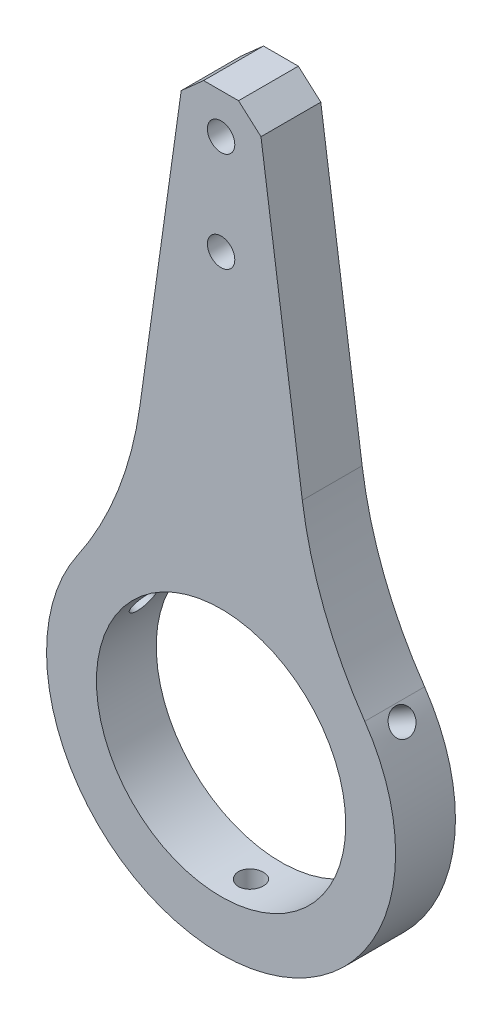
ISO-10303-21;
HEADER;
FILE_DESCRIPTION(('STEP AP214'),'2;1');
FILE_NAME('part.step','',(''),(''),'','','');
FILE_SCHEMA(('AUTOMOTIVE_DESIGN { 1 0 10303 214 1 1 1 1 }'));
ENDSEC;
DATA;
#1=APPLICATION_CONTEXT('core data for automotive mechanical design processes');
#2=APPLICATION_PROTOCOL_DEFINITION('international standard','automotive_design',2000,#1);
#3=PRODUCT_CONTEXT('',#1,'mechanical');
#4=PRODUCT('Part','Part','',(#3));
#5=PRODUCT_RELATED_PRODUCT_CATEGORY('part','',(#4));
#6=PRODUCT_DEFINITION_FORMATION('','',#4);
#7=PRODUCT_DEFINITION_CONTEXT('part definition',#1,'design');
#8=PRODUCT_DEFINITION('design','',#6,#7);
#9=PRODUCT_DEFINITION_SHAPE('','',#8);
#10=(LENGTH_UNIT() NAMED_UNIT(*) SI_UNIT(.MILLI.,.METRE.));
#11=(NAMED_UNIT(*) PLANE_ANGLE_UNIT() SI_UNIT($,.RADIAN.));
#12=(NAMED_UNIT(*) SI_UNIT($,.STERADIAN.) SOLID_ANGLE_UNIT());
#13=UNCERTAINTY_MEASURE_WITH_UNIT(LENGTH_MEASURE(1.E-05),#10,'distance_accuracy_value','');
#14=(GEOMETRIC_REPRESENTATION_CONTEXT(3) GLOBAL_UNCERTAINTY_ASSIGNED_CONTEXT((#13)) GLOBAL_UNIT_ASSIGNED_CONTEXT((#10,
#11,#12)) REPRESENTATION_CONTEXT('',''));
#15=CARTESIAN_POINT('',(0.,0.,0.));
#16=DIRECTION('',(0.,0.,1.));
#17=DIRECTION('',(1.,0.,0.));
#18=AXIS2_PLACEMENT_3D('',#15,#16,#17);
#19=CARTESIAN_POINT('',(-90.5619863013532,62.4381825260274,12.));
#20=DIRECTION('',(0.,0.,1.));
#21=DIRECTION('',(1.,0.,0.));
#22=AXIS2_PLACEMENT_3D('',#19,#20,#21);
#23=PLANE('',#22);
#24=CARTESIAN_POINT('',(0.,87.,12.));
#25=DIRECTION('',(0.,0.,1.));
#26=DIRECTION('',(1.,0.,0.));
#27=AXIS2_PLACEMENT_3D('',#24,#25,#26);
#28=CIRCLE('',#27,2.75);
#29=CARTESIAN_POINT('',(2.75000000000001,87.,12.));
#30=VERTEX_POINT('',#29);
#31=EDGE_CURVE('E273',#30,#30,#28,.T.);
#32=ORIENTED_EDGE('',*,*,#31,.F.);
#33=EDGE_LOOP('',(#32));
#34=FACE_BOUND('',#33,.T.);
#35=CARTESIAN_POINT('',(-90.5619863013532,62.4381825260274,12.));
#36=DIRECTION('',(0.,0.,-1.));
#37=DIRECTION('',(1.,0.,0.));
#38=AXIS2_PLACEMENT_3D('',#35,#36,#37);
#39=CIRCLE('',#38,75.);
#40=CARTESIAN_POINT('',(-16.2918811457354,52.000199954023,12.));
#41=VERTEX_POINT('',#40);
#42=CARTESIAN_POINT('',(-28.8151774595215,19.8666944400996,12.));
#43=VERTEX_POINT('',#42);
#44=EDGE_CURVE('E151',#41,#43,#39,.T.);
#45=ORIENTED_EDGE('',*,*,#44,.T.);
#46=CARTESIAN_POINT('',(0.,0.,12.));
#47=DIRECTION('',(0.,0.,1.));
#48=DIRECTION('',(1.,0.,0.));
#49=AXIS2_PLACEMENT_3D('',#46,#47,#48);
#50=CIRCLE('',#49,35.);
#51=CARTESIAN_POINT('',(28.8151774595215,19.8666944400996,12.));
#52=VERTEX_POINT('',#51);
#53=EDGE_CURVE('E99',#43,#52,#50,.T.);
#54=ORIENTED_EDGE('',*,*,#53,.T.);
#55=CARTESIAN_POINT('',(90.5619863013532,62.4381825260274,12.));
#56=DIRECTION('',(0.,0.,-1.));
#57=DIRECTION('',(-1.,0.,0.));
#58=AXIS2_PLACEMENT_3D('',#55,#56,#57);
#59=CIRCLE('',#58,75.);
#60=CARTESIAN_POINT('',(16.2918811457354,52.000199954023,12.));
#61=VERTEX_POINT('',#60);
#62=EDGE_CURVE('E263',#52,#61,#59,.T.);
#63=ORIENTED_EDGE('',*,*,#62,.T.);
#64=DIRECTION('',(-0.139173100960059,0.990268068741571,0.));
#65=VECTOR('',#64,1.);
#66=CARTESIAN_POINT('',(16.2918811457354,52.000199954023,12.));
#67=LINE('',#66,#65);
#68=CARTESIAN_POINT('',(8.,111.,12.));
#69=VERTEX_POINT('',#68);
#70=EDGE_CURVE('E270',#61,#69,#67,.T.);
#71=ORIENTED_EDGE('',*,*,#70,.T.);
#72=DIRECTION('',(-0.747409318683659,0.66436383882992,0.));
#73=VECTOR('',#72,1.);
#74=CARTESIAN_POINT('',(8.,111.,12.));
#75=LINE('',#74,#73);
#76=CARTESIAN_POINT('',(3.5,115.,12.));
#77=VERTEX_POINT('',#76);
#78=EDGE_CURVE('E118',#69,#77,#75,.T.);
#79=ORIENTED_EDGE('',*,*,#78,.T.);
#80=DIRECTION('',(-1.,0.,0.));
#81=VECTOR('',#80,1.);
#82=CARTESIAN_POINT('',(-3.5,115.,12.));
#83=LINE('',#82,#81);
#84=CARTESIAN_POINT('',(-3.5,115.,12.));
#85=VERTEX_POINT('',#84);
#86=EDGE_CURVE('E112',#77,#85,#83,.T.);
#87=ORIENTED_EDGE('',*,*,#86,.T.);
#88=DIRECTION('',(-0.747409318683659,-0.66436383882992,0.));
#89=VECTOR('',#88,1.);
#90=CARTESIAN_POINT('',(-8.,111.,12.));
#91=LINE('',#90,#89);
#92=CARTESIAN_POINT('',(-8.,111.,12.));
#93=VERTEX_POINT('',#92);
#94=EDGE_CURVE('E116',#85,#93,#91,.T.);
#95=ORIENTED_EDGE('',*,*,#94,.T.);
#96=DIRECTION('',(-0.139173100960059,-0.990268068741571,0.));
#97=VECTOR('',#96,1.);
#98=CARTESIAN_POINT('',(-16.2918811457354,52.000199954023,12.));
#99=LINE('',#98,#97);
#100=EDGE_CURVE('E56',#93,#41,#99,.T.);
#101=ORIENTED_EDGE('',*,*,#100,.T.);
#102=EDGE_LOOP('',(#45,#54,#63,#71,#79,#87,#95,#101));
#103=FACE_BOUND('',#102,.T.);
#104=CARTESIAN_POINT('',(0.,0.,12.));
#105=DIRECTION('',(0.,0.,1.));
#106=DIRECTION('',(1.,0.,0.));
#107=AXIS2_PLACEMENT_3D('',#104,#105,#106);
#108=CIRCLE('',#107,25.);
#109=CARTESIAN_POINT('',(25.,0.,12.));
#110=VERTEX_POINT('',#109);
#111=EDGE_CURVE('E140',#110,#110,#108,.T.);
#112=ORIENTED_EDGE('',*,*,#111,.F.);
#113=EDGE_LOOP('',(#112));
#114=FACE_BOUND('',#113,.T.);
#115=CARTESIAN_POINT('',(0.,107.,12.));
#116=DIRECTION('',(0.,0.,1.));
#117=DIRECTION('',(1.,0.,0.));
#118=AXIS2_PLACEMENT_3D('',#115,#116,#117);
#119=CIRCLE('',#118,2.75);
#120=CARTESIAN_POINT('',(2.75000000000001,107.,12.));
#121=VERTEX_POINT('',#120);
#122=EDGE_CURVE('E197',#121,#121,#119,.T.);
#123=ORIENTED_EDGE('',*,*,#122,.F.);
#124=EDGE_LOOP('',(#123));
#125=FACE_BOUND('',#124,.T.);
#126=ADVANCED_FACE('F33',(#34,#103,#114,#125),#23,.T.);
#127=CARTESIAN_POINT('',(-90.5619863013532,62.4381825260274,0.));
#128=DIRECTION('',(0.,0.,1.));
#129=DIRECTION('',(1.,0.,0.));
#130=AXIS2_PLACEMENT_3D('',#127,#128,#129);
#131=PLANE('',#130);
#132=CARTESIAN_POINT('',(0.,87.,0.));
#133=DIRECTION('',(0.,0.,1.));
#134=DIRECTION('',(1.,0.,0.));
#135=AXIS2_PLACEMENT_3D('',#132,#133,#134);
#136=CIRCLE('',#135,2.75);
#137=CARTESIAN_POINT('',(2.75000000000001,87.,0.));
#138=VERTEX_POINT('',#137);
#139=EDGE_CURVE('E276',#138,#138,#136,.T.);
#140=ORIENTED_EDGE('',*,*,#139,.T.);
#141=EDGE_LOOP('',(#140));
#142=FACE_BOUND('',#141,.T.);
#143=CARTESIAN_POINT('',(-90.5619863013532,62.4381825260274,0.));
#144=DIRECTION('',(0.,0.,-1.));
#145=DIRECTION('',(1.,0.,0.));
#146=AXIS2_PLACEMENT_3D('',#143,#144,#145);
#147=CIRCLE('',#146,75.);
#148=CARTESIAN_POINT('',(-16.2918811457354,52.000199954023,0.));
#149=VERTEX_POINT('',#148);
#150=CARTESIAN_POINT('',(-28.8151774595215,19.8666944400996,0.));
#151=VERTEX_POINT('',#150);
#152=EDGE_CURVE('E136',#149,#151,#147,.T.);
#153=ORIENTED_EDGE('',*,*,#152,.F.);
#154=DIRECTION('',(-0.139173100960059,-0.990268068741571,0.));
#155=VECTOR('',#154,1.);
#156=CARTESIAN_POINT('',(-16.2918811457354,52.000199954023,0.));
#157=LINE('',#156,#155);
#158=CARTESIAN_POINT('',(-8.,111.,0.));
#159=VERTEX_POINT('',#158);
#160=EDGE_CURVE('E91',#159,#149,#157,.T.);
#161=ORIENTED_EDGE('',*,*,#160,.F.);
#162=DIRECTION('',(-0.747409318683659,-0.66436383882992,0.));
#163=VECTOR('',#162,1.);
#164=CARTESIAN_POINT('',(-8.,111.,0.));
#165=LINE('',#164,#163);
#166=CARTESIAN_POINT('',(-3.5,115.,0.));
#167=VERTEX_POINT('',#166);
#168=EDGE_CURVE('E85',#167,#159,#165,.T.);
#169=ORIENTED_EDGE('',*,*,#168,.F.);
#170=DIRECTION('',(-1.,0.,0.));
#171=VECTOR('',#170,1.);
#172=CARTESIAN_POINT('',(-3.5,115.,0.));
#173=LINE('',#172,#171);
#174=CARTESIAN_POINT('',(3.5,115.,0.));
#175=VERTEX_POINT('',#174);
#176=EDGE_CURVE('E126',#175,#167,#173,.T.);
#177=ORIENTED_EDGE('',*,*,#176,.F.);
#178=DIRECTION('',(-0.747409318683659,0.66436383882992,0.));
#179=VECTOR('',#178,1.);
#180=CARTESIAN_POINT('',(8.,111.,0.));
#181=LINE('',#180,#179);
#182=CARTESIAN_POINT('',(8.,111.,0.));
#183=VERTEX_POINT('',#182);
#184=EDGE_CURVE('E146',#183,#175,#181,.T.);
#185=ORIENTED_EDGE('',*,*,#184,.F.);
#186=DIRECTION('',(-0.139173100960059,0.990268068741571,0.));
#187=VECTOR('',#186,1.);
#188=CARTESIAN_POINT('',(16.2918811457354,52.000199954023,0.));
#189=LINE('',#188,#187);
#190=CARTESIAN_POINT('',(16.2918811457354,52.000199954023,0.));
#191=VERTEX_POINT('',#190);
#192=EDGE_CURVE('E144',#191,#183,#189,.T.);
#193=ORIENTED_EDGE('',*,*,#192,.F.);
#194=CARTESIAN_POINT('',(90.5619863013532,62.4381825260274,0.));
#195=DIRECTION('',(0.,0.,-1.));
#196=DIRECTION('',(-1.,0.,0.));
#197=AXIS2_PLACEMENT_3D('',#194,#195,#196);
#198=CIRCLE('',#197,75.);
#199=CARTESIAN_POINT('',(28.8151774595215,19.8666944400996,0.));
#200=VERTEX_POINT('',#199);
#201=EDGE_CURVE('E142',#200,#191,#198,.T.);
#202=ORIENTED_EDGE('',*,*,#201,.F.);
#203=CARTESIAN_POINT('',(0.,0.,0.));
#204=DIRECTION('',(0.,0.,1.));
#205=DIRECTION('',(1.,0.,0.));
#206=AXIS2_PLACEMENT_3D('',#203,#204,#205);
#207=CIRCLE('',#206,35.);
#208=EDGE_CURVE('E139',#151,#200,#207,.T.);
#209=ORIENTED_EDGE('',*,*,#208,.F.);
#210=EDGE_LOOP('',(#153,#161,#169,#177,#185,#193,#202,#209));
#211=FACE_BOUND('',#210,.T.);
#212=CARTESIAN_POINT('',(0.,0.,0.));
#213=DIRECTION('',(0.,0.,1.));
#214=DIRECTION('',(1.,0.,0.));
#215=AXIS2_PLACEMENT_3D('',#212,#213,#214);
#216=CIRCLE('',#215,25.);
#217=CARTESIAN_POINT('',(25.,0.,0.));
#218=VERTEX_POINT('',#217);
#219=EDGE_CURVE('E266',#218,#218,#216,.T.);
#220=ORIENTED_EDGE('',*,*,#219,.T.);
#221=EDGE_LOOP('',(#220));
#222=FACE_BOUND('',#221,.T.);
#223=CARTESIAN_POINT('',(0.,107.,0.));
#224=DIRECTION('',(0.,0.,1.));
#225=DIRECTION('',(1.,0.,0.));
#226=AXIS2_PLACEMENT_3D('',#223,#224,#225);
#227=CIRCLE('',#226,2.75);
#228=CARTESIAN_POINT('',(2.75000000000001,107.,0.));
#229=VERTEX_POINT('',#228);
#230=EDGE_CURVE('E193',#229,#229,#227,.T.);
#231=ORIENTED_EDGE('',*,*,#230,.T.);
#232=EDGE_LOOP('',(#231));
#233=FACE_BOUND('',#232,.T.);
#234=ADVANCED_FACE('F224',(#142,#211,#222,#233),#131,.F.);
#235=CARTESIAN_POINT('',(-90.5619863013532,62.4381825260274,12.));
#236=DIRECTION('',(0.,0.,-1.));
#237=DIRECTION('',(-1.,0.,0.));
#238=AXIS2_PLACEMENT_3D('',#235,#236,#237);
#239=CYLINDRICAL_SURFACE('',#238,75.);
#240=ORIENTED_EDGE('',*,*,#152,.T.);
#241=DIRECTION('',(0.,0.,-1.));
#242=VECTOR('',#241,1.);
#243=CARTESIAN_POINT('',(-28.8151774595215,19.8666944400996,12.));
#244=LINE('',#243,#242);
#245=EDGE_CURVE('E11',#43,#151,#244,.T.);
#246=ORIENTED_EDGE('',*,*,#245,.F.);
#247=ORIENTED_EDGE('',*,*,#44,.F.);
#248=DIRECTION('',(0.,0.,-1.));
#249=VECTOR('',#248,1.);
#250=CARTESIAN_POINT('',(-16.2918811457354,52.000199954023,12.));
#251=LINE('',#250,#249);
#252=EDGE_CURVE('E132',#41,#149,#251,.T.);
#253=ORIENTED_EDGE('',*,*,#252,.T.);
#254=EDGE_LOOP('',(#240,#246,#247,#253));
#255=FACE_BOUND('',#254,.T.);
#256=ADVANCED_FACE('F35',(#255),#239,.F.);
#257=CARTESIAN_POINT('',(0.,0.,12.));
#258=DIRECTION('',(0.,0.,-1.));
#259=DIRECTION('',(-1.,0.,0.));
#260=AXIS2_PLACEMENT_3D('',#257,#258,#259);
#261=CYLINDRICAL_SURFACE('',#260,35.);
#262=CARTESIAN_POINT('',(-31.4834665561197,15.2902365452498,6.));
#263=CARTESIAN_POINT('',(-31.483464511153,15.2902424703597,5.85976621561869));
#264=CARTESIAN_POINT('',(-31.4782867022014,15.3009164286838,5.71943531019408));
#265=CARTESIAN_POINT('',(-31.4576455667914,15.3433070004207,5.44265148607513));
#266=CARTESIAN_POINT('',(-31.4421703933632,15.3750478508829,5.30620322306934));
#267=CARTESIAN_POINT('',(-31.4012010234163,15.4585485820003,5.04123380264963));
#268=CARTESIAN_POINT('',(-31.3757122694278,15.5102975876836,4.91270838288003));
#269=CARTESIAN_POINT('',(-31.3151712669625,15.6321673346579,4.66717594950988));
#270=CARTESIAN_POINT('',(-31.2801211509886,15.702283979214,4.55016637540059));
#271=CARTESIAN_POINT('',(-31.2010359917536,15.8588472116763,4.33072981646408));
#272=CARTESIAN_POINT('',(-31.1569857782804,15.9453213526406,4.22832795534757));
#273=CARTESIAN_POINT('',(-31.0608071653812,16.1318705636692,4.04122903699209));
#274=CARTESIAN_POINT('',(-31.008678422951,16.2319462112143,3.95653273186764));
#275=CARTESIAN_POINT('',(-30.8973975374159,16.442780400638,3.80716894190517));
#276=CARTESIAN_POINT('',(-30.8382380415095,16.5535501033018,3.74252268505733));
#277=CARTESIAN_POINT('',(-30.7143127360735,16.7823688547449,3.63522990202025));
#278=CARTESIAN_POINT('',(-30.6495470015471,16.9004178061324,3.59258308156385));
#279=CARTESIAN_POINT('',(-30.5161524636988,17.14010523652,3.5305706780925));
#280=CARTESIAN_POINT('',(-30.4475305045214,17.2617371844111,3.51116513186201));
#281=CARTESIAN_POINT('',(-30.3081751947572,17.5052618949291,3.49606266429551));
#282=CARTESIAN_POINT('',(-30.2374418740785,17.6271546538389,3.50036540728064));
#283=CARTESIAN_POINT('',(-30.096031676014,17.867520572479,3.53252453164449));
#284=CARTESIAN_POINT('',(-30.025354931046,17.9859995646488,3.56033793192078));
#285=CARTESIAN_POINT('',(-29.8860736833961,18.2164965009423,3.63866209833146));
#286=CARTESIAN_POINT('',(-29.8174691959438,18.3285143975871,3.68917303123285));
#287=CARTESIAN_POINT('',(-29.6844547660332,18.5431691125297,3.81150681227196));
#288=CARTESIAN_POINT('',(-29.6200487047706,18.645797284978,3.88334904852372));
#289=CARTESIAN_POINT('',(-29.4976358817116,18.8388578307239,4.04629200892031));
#290=CARTESIAN_POINT('',(-29.4396292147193,18.929290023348,4.13739301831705));
#291=CARTESIAN_POINT('',(-29.3318903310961,19.0958134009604,4.3365100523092));
#292=CARTESIAN_POINT('',(-29.2821768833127,19.1718721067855,4.44456339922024));
#293=CARTESIAN_POINT('',(-29.1929570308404,19.3074562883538,4.67438738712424));
#294=CARTESIAN_POINT('',(-29.1534506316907,19.3669817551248,4.79615803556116));
#295=CARTESIAN_POINT('',(-29.0860934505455,19.4679961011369,5.04998483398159));
#296=CARTESIAN_POINT('',(-29.0582436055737,19.5094835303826,5.18204180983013));
#297=CARTESIAN_POINT('',(-29.0152525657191,19.5733649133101,5.45268107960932));
#298=CARTESIAN_POINT('',(-29.0001111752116,19.5957591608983,5.5912632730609));
#299=CARTESIAN_POINT('',(-28.9831340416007,19.620860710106,5.87069152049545));
#300=CARTESIAN_POINT('',(-28.9812689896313,19.6236113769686,6.01153189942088));
#301=CARTESIAN_POINT('',(-28.9908383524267,19.6094712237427,6.29176650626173));
#302=CARTESIAN_POINT('',(-29.0022726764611,19.5925805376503,6.43116074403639));
#303=CARTESIAN_POINT('',(-29.0379852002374,19.5396116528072,6.70439765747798));
#304=CARTESIAN_POINT('',(-29.062249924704,19.5035535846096,6.83824599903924));
#305=CARTESIAN_POINT('',(-29.1227031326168,19.4131682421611,7.09676678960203));
#306=CARTESIAN_POINT('',(-29.1588917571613,19.3588407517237,7.2214391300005));
#307=CARTESIAN_POINT('',(-29.2419348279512,19.233172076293,7.45830839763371));
#308=CARTESIAN_POINT('',(-29.2888078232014,19.161801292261,7.57048311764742));
#309=CARTESIAN_POINT('',(-29.391501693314,19.0039068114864,7.7789489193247));
#310=CARTESIAN_POINT('',(-29.4473226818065,18.9173829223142,7.87523979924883));
#311=CARTESIAN_POINT('',(-29.566079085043,18.7312347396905,8.04938166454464));
#312=CARTESIAN_POINT('',(-29.6290272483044,18.6315869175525,8.12719881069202));
#313=CARTESIAN_POINT('',(-29.7598326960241,18.4219326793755,8.26195246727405));
#314=CARTESIAN_POINT('',(-29.8276899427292,18.3119263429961,8.31888913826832));
#315=CARTESIAN_POINT('',(-29.9660481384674,18.0846241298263,8.41020705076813));
#316=CARTESIAN_POINT('',(-30.0365465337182,17.9673352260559,8.44460951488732));
#317=CARTESIAN_POINT('',(-30.1780650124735,17.7286107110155,8.48995187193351));
#318=CARTESIAN_POINT('',(-30.2490850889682,17.6071751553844,8.5008920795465));
#319=CARTESIAN_POINT('',(-30.389406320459,17.363860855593,8.49899610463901));
#320=CARTESIAN_POINT('',(-30.4587109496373,17.2419836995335,8.48621279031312));
#321=CARTESIAN_POINT('',(-30.5938636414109,17.001017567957,8.43734251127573));
#322=CARTESIAN_POINT('',(-30.6597116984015,16.881928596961,8.40125550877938));
#323=CARTESIAN_POINT('',(-30.7862681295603,16.650019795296,8.30681481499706));
#324=CARTESIAN_POINT('',(-30.8469766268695,16.5371998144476,8.24846165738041));
#325=CARTESIAN_POINT('',(-30.9618224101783,16.3211683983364,8.11115174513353));
#326=CARTESIAN_POINT('',(-31.0159598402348,16.2179567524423,8.03219544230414));
#327=CARTESIAN_POINT('',(-31.1165941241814,16.0240304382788,7.85572324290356));
#328=CARTESIAN_POINT('',(-31.1630746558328,15.9333425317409,7.75816863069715));
#329=CARTESIAN_POINT('',(-31.2473275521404,15.7674728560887,7.54733062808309));
#330=CARTESIAN_POINT('',(-31.2850977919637,15.6922948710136,7.43404341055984));
#331=CARTESIAN_POINT('',(-31.3512505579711,15.5597109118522,7.19479142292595));
#332=CARTESIAN_POINT('',(-31.3796190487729,15.5023315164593,7.06880806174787));
#333=CARTESIAN_POINT('',(-31.4263576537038,15.4073642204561,6.80796452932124));
#334=CARTESIAN_POINT('',(-31.4447393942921,15.3697533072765,6.67311488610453));
#335=CARTESIAN_POINT('',(-31.4664605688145,15.3252147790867,6.4478762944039));
#336=CARTESIAN_POINT('',(-31.4728323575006,15.3121167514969,6.35894055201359));
#337=CARTESIAN_POINT('',(-31.4813360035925,15.2946257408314,6.18001654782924));
#338=CARTESIAN_POINT('',(-31.4834678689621,15.2902327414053,6.09002828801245));
#339=CARTESIAN_POINT('',(-31.4834665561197,15.2902365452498,6.));
#340=B_SPLINE_CURVE_WITH_KNOTS('',3,(#262,#263,#264,#265,#266,#267,#268,#269,#270,#271,#272,
#273,#274,#275,#276,#277,#278,#279,#280,#281,#282,#283,#284,#285,#286,#287,#288,#289,#290,#291,
#292,#293,#294,#295,#296,#297,#298,#299,#300,#301,#302,#303,#304,#305,#306,#307,#308,#309,#310,
#311,#312,#313,#314,#315,#316,#317,#318,#319,#320,#321,#322,#323,#324,#325,#326,#327,#328,#329,
#330,#331,#332,#333,#334,#335,#336,#337,#338,#339),.UNSPECIFIED.,.T.,.F.,(4,2,2,2,2,2,2,2,2,2,2,
2,2,2,2,2,2,2,2,2,2,2,2,2,2,2,2,2,2,2,2,2,2,2,2,2,2,2,4),(0.,0.420372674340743,0.84122981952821,
1.26185853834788,1.68239351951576,2.10364327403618,2.52491091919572,2.94662307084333,
3.3683295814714,3.78930992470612,4.21028430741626,4.63049074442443,5.05070026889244,
5.47129289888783,5.89189175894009,6.31342995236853,6.73496837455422,7.15654067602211,
7.57810648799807,7.99874136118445,8.41937336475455,8.83956446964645,9.25976054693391,
9.68069175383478,10.101628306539,10.5233300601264,10.9450285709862,11.3663293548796,
11.7876244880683,12.2079818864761,12.6283399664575,13.0486879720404,13.4690267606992,
13.8902503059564,14.311576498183,14.7335288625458,15.1549889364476,15.4248632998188,
15.694737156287),.UNSPECIFIED.);
#341=CARTESIAN_POINT('',(-31.4834665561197,15.2902365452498,6.));
#342=VERTEX_POINT('',#341);
#343=EDGE_CURVE('E208',#342,#342,#340,.T.);
#344=ORIENTED_EDGE('',*,*,#343,.T.);
#345=EDGE_LOOP('',(#344));
#346=FACE_BOUND('',#345,.T.);
#347=CARTESIAN_POINT('',(28.9834665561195,19.6203635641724,6.));
#348=CARTESIAN_POINT('',(28.9834706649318,19.6203588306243,5.85976621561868));
#349=CARTESIAN_POINT('',(28.9901256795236,19.6105377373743,5.71943531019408));
#350=CARTESIAN_POINT('',(29.0165164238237,19.5714667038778,5.44265148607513));
#351=CARTESIAN_POINT('',(29.0362672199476,19.5421943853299,5.30620322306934));
#352=CARTESIAN_POINT('',(29.0880962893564,19.4649635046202,5.04123380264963));
#353=CARTESIAN_POINT('',(29.1201678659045,19.4170150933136,4.91270838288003));
#354=CARTESIAN_POINT('',(29.1954396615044,19.303650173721,4.66717594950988));
#355=CARTESIAN_POINT('',(29.2386373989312,19.2382375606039,4.55016637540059));
#356=CARTESIAN_POINT('',(29.3346825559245,19.0914661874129,4.33072981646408));
#357=CARTESIAN_POINT('',(29.3875462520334,19.0100805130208,4.22832795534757));
#358=CARTESIAN_POINT('',(29.5010133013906,18.8335127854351,4.04122903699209));
#359=CARTESIAN_POINT('',(29.5616169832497,18.7383301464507,3.95653273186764));
#360=CARTESIAN_POINT('',(29.6885643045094,18.5365409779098,3.80716894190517));
#361=CARTESIAN_POINT('',(29.7549139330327,18.4299225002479,3.74252268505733));
#362=CARTESIAN_POINT('',(29.8911141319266,18.208190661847,3.63522990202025));
#363=CARTESIAN_POINT('',(29.9609646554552,18.0930774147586,3.59258308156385));
#364=CARTESIAN_POINT('',(30.1018427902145,17.8577106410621,3.5305706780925));
#365=CARTESIAN_POINT('',(30.1728681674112,17.7374663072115,3.51116513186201));
#366=CARTESIAN_POINT('',(30.314089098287,17.4950187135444,3.49606266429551));
#367=CARTESIAN_POINT('',(30.3842846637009,17.3728154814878,3.50036540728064));
#368=CARTESIAN_POINT('',(30.521742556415,17.1301676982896,3.53252453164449));
#369=CARTESIAN_POINT('',(30.5890100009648,17.0097203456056,3.56033793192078));
#370=CARTESIAN_POINT('',(30.7189855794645,16.7738507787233,3.63866209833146));
#371=CARTESIAN_POINT('',(30.7816936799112,16.6584286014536,3.68917303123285));
#372=CARTESIAN_POINT('',(30.9010829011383,16.4359073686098,3.81150681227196));
#373=CARTESIAN_POINT('',(30.9577584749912,16.3288159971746,3.88334904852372));
#374=CARTESIAN_POINT('',(31.0637474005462,16.1262731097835,4.04629200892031));
#375=CARTESIAN_POINT('',(31.1130606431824,16.0308217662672,4.13739301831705));
#376=CARTESIAN_POINT('',(31.2034046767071,15.8542554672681,4.3365100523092));
#377=CARTESIAN_POINT('',(31.2444167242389,15.7731730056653,4.44456339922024));
#378=CARTESIAN_POINT('',(31.3172261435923,15.6281142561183,4.67438738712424));
#379=CARTESIAN_POINT('',(31.3490235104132,15.5641379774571,4.79615803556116));
#380=CARTESIAN_POINT('',(31.4028259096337,15.455297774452,5.04998483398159));
#381=CARTESIAN_POINT('',(31.4248301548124,15.4104353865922,5.18204180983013));
#382=CARTESIAN_POINT('',(31.4586575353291,15.3412633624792,5.45268107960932));
#383=CARTESIAN_POINT('',(31.4704808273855,15.3169534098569,5.5912632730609));
#384=CARTESIAN_POINT('',(31.4837308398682,15.2897000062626,5.87069152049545));
#385=CARTESIAN_POINT('',(31.4851804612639,15.2867094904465,6.01153189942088));
#386=CARTESIAN_POINT('',(31.4777194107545,15.3020668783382,6.29176650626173));
#387=CARTESIAN_POINT('',(31.4688088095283,15.3204146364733,6.43116074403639));
#388=CARTESIAN_POINT('',(31.4407926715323,15.3778270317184,6.70439765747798));
#389=CARTESIAN_POINT('',(31.4216978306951,15.416869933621,6.83824599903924));
#390=CARTESIAN_POINT('',(31.3736484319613,15.5144166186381,7.09676678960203));
#391=CARTESIAN_POINT('',(31.3446937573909,15.5729206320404,7.2214391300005));
#392=CARTESIAN_POINT('',(31.2773830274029,15.7076723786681,7.45830839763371));
#393=CARTESIAN_POINT('',(31.2390106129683,15.7839509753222,7.57048311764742));
#394=CARTESIAN_POINT('',(31.1536169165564,15.95183371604,7.7789489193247));
#395=CARTESIAN_POINT('',(31.1065955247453,16.0434380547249,7.87523979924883));
#396=CARTESIAN_POINT('',(31.0047646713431,16.2393582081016,8.04938166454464));
#397=CARTESIAN_POINT('',(30.9499412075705,16.3436968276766,8.12719881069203));
#398=CARTESIAN_POINT('',(30.833778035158,16.5618047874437,8.26195246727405));
#399=CARTESIAN_POINT('',(30.7724383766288,16.6755740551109,8.31888913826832));
#400=CARTESIAN_POINT('',(30.6447679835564,16.9090468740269,8.41020705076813));
#401=CARTESIAN_POINT('',(30.5784420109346,17.0287447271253,8.44460951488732));
#402=CARTESIAN_POINT('',(30.4424597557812,17.2706655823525,8.48995187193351));
#403=CARTESIAN_POINT('',(30.3728035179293,17.3928885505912,8.5008920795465));
#404=CARTESIAN_POINT('',(30.2322477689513,17.6360674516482,8.49899610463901));
#405=CARTESIAN_POINT('',(30.161351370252,17.7570255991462,8.48621279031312));
#406=CARTESIAN_POINT('',(30.0202449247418,17.9945543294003,8.43734251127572));
#407=CARTESIAN_POINT('',(29.9500348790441,18.111124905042,8.40125550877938));
#408=CARTESIAN_POINT('',(29.8124741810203,18.3366803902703,8.30681481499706));
#409=CARTESIAN_POINT('',(29.7451234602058,18.4456654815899,8.24846165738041));
#410=CARTESIAN_POINT('',(29.6154576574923,18.6531405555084,8.11115174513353));
#411=CARTESIAN_POINT('',(29.5531424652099,18.75163076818,8.03219544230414));
#412=CARTESIAN_POINT('',(29.4355144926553,18.9357457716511,7.85572324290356));
#413=CARTESIAN_POINT('',(29.3802167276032,19.0213430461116,7.75816863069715));
#414=CARTESIAN_POINT('',(29.2786958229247,19.1772430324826,7.5473306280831));
#415=CARTESIAN_POINT('',(29.232474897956,19.2475420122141,7.43404341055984));
#416=CARTESIAN_POINT('',(29.1507302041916,19.3711239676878,7.19479142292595));
#417=CARTESIAN_POINT('',(29.1152224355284,19.4243814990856,7.06880806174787));
#418=CARTESIAN_POINT('',(29.0563476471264,19.5123419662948,6.80796452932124));
#419=CARTESIAN_POINT('',(29.0329665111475,19.5470664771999,6.67311488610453));
#420=CARTESIAN_POINT('',(29.0052556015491,19.5881468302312,6.44787629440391));
#421=CARTESIAN_POINT('',(28.9970982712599,19.6002139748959,6.35894055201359));
#422=CARTESIAN_POINT('',(28.9862024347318,19.616323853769,6.18001654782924));
#423=CARTESIAN_POINT('',(28.9834639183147,19.6203666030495,6.09002828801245));
#424=CARTESIAN_POINT('',(28.9834665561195,19.6203635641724,6.));
#425=B_SPLINE_CURVE_WITH_KNOTS('',3,(#347,#348,#349,#350,#351,#352,#353,#354,#355,#356,#357,
#358,#359,#360,#361,#362,#363,#364,#365,#366,#367,#368,#369,#370,#371,#372,#373,#374,#375,#376,
#377,#378,#379,#380,#381,#382,#383,#384,#385,#386,#387,#388,#389,#390,#391,#392,#393,#394,#395,
#396,#397,#398,#399,#400,#401,#402,#403,#404,#405,#406,#407,#408,#409,#410,#411,#412,#413,#414,
#415,#416,#417,#418,#419,#420,#421,#422,#423,#424),.UNSPECIFIED.,.T.,.F.,(4,2,2,2,2,2,2,2,2,2,2,
2,2,2,2,2,2,2,2,2,2,2,2,2,2,2,2,2,2,2,2,2,2,2,2,2,2,2,4),(0.,0.420372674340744,0.84122981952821,
1.26185853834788,1.68239351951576,2.10364327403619,2.52491091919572,2.94662307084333,
3.36832958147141,3.78930992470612,4.21028430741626,4.63049074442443,5.05070026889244,
5.47129289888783,5.89189175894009,6.31342995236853,6.73496837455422,7.15654067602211,
7.57810648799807,7.99874136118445,8.41937336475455,8.83956446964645,9.25976054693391,
9.68069175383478,10.101628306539,10.5233300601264,10.9450285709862,11.3663293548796,
11.7876244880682,12.2079818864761,12.6283399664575,13.0486879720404,13.4690267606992,
13.8902503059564,14.311576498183,14.7335288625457,15.1549889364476,15.4248632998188,
15.694737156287),.UNSPECIFIED.);
#426=CARTESIAN_POINT('',(28.9834665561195,19.6203635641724,6.));
#427=VERTEX_POINT('',#426);
#428=EDGE_CURVE('E169',#427,#427,#425,.T.);
#429=ORIENTED_EDGE('',*,*,#428,.T.);
#430=EDGE_LOOP('',(#429));
#431=FACE_BOUND('',#430,.T.);
#432=CARTESIAN_POINT('',(2.5,-34.9106001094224,6.));
#433=CARTESIAN_POINT('',(2.49999384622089,-34.9106013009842,5.85976621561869));
#434=CARTESIAN_POINT('',(2.48816102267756,-34.9114541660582,5.71943531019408));
#435=CARTESIAN_POINT('',(2.44112914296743,-34.9147737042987,5.44265148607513));
#436=CARTESIAN_POINT('',(2.40590317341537,-34.9172422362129,5.30620322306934));
#437=CARTESIAN_POINT('',(2.31310473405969,-34.9235120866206,5.04123380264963));
#438=CARTESIAN_POINT('',(2.2555444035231,-34.9273126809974,4.91270838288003));
#439=CARTESIAN_POINT('',(2.11973160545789,-34.935817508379,4.66717594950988));
#440=CARTESIAN_POINT('',(2.04148375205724,-34.9405215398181,4.55016637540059));
#441=CARTESIAN_POINT('',(1.8663534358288,-34.9503133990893,4.33072981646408));
#442=CARTESIAN_POINT('',(1.76943952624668,-34.9554018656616,4.22832795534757));
#443=CARTESIAN_POINT('',(1.55979386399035,-34.9653833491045,4.04122903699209));
#444=CARTESIAN_POINT('',(1.44706143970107,-34.9702763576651,3.95653273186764));
#445=CARTESIAN_POINT('',(1.20883323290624,-34.979321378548,3.80716894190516));
#446=CARTESIAN_POINT('',(1.08332410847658,-34.9834726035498,3.74252268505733));
#447=CARTESIAN_POINT('',(0.82319860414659,-34.990559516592,3.63522990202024));
#448=CARTESIAN_POINT('',(0.688582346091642,-34.9934952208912,3.59258308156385));
#449=CARTESIAN_POINT('',(0.414309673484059,-34.9978158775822,3.5305706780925));
#450=CARTESIAN_POINT('',(0.27466233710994,-34.9992034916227,3.51116513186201));
#451=CARTESIAN_POINT('',(-0.00591390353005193,-35.0002806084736,3.49606266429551));
#452=CARTESIAN_POINT('',(-0.146842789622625,-34.9999701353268,3.50036540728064));
#453=CARTESIAN_POINT('',(-0.4257108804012,-34.9976882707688,3.53252453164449));
#454=CARTESIAN_POINT('',(-0.563655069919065,-34.9957199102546,3.56033793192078));
#455=CARTESIAN_POINT('',(-0.832911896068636,-34.9903472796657,3.63866209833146));
#456=CARTESIAN_POINT('',(-0.96422448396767,-34.9869429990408,3.68917303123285));
#457=CARTESIAN_POINT('',(-1.21662813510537,-34.9790764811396,3.81150681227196));
#458=CARTESIAN_POINT('',(-1.33770977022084,-34.9746132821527,3.88334904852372));
#459=CARTESIAN_POINT('',(-1.56611151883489,-34.9651309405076,4.04629200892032));
#460=CARTESIAN_POINT('',(-1.67343142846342,-34.9601117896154,4.13739301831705));
#461=CARTESIAN_POINT('',(-1.87151434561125,-34.9500688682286,4.3365100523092));
#462=CARTESIAN_POINT('',(-1.96223984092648,-34.9450451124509,4.44456339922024));
#463=CARTESIAN_POINT('',(-2.1242691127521,-34.9355705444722,4.67438738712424));
#464=CARTESIAN_POINT('',(-2.19557287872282,-34.931119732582,4.79615803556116));
#465=CARTESIAN_POINT('',(-2.31673245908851,-34.9232938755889,5.04998483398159));
#466=CARTESIAN_POINT('',(-2.36658654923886,-34.9199189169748,5.18204180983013));
#467=CARTESIAN_POINT('',(-2.44340496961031,-34.9146282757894,5.45268107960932));
#468=CARTESIAN_POINT('',(-2.47036965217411,-34.9127125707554,5.5912632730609));
#469=CARTESIAN_POINT('',(-2.50059679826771,-34.9105607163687,5.87069152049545));
#470=CARTESIAN_POINT('',(-2.50391147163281,-34.9103208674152,6.01153189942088));
#471=CARTESIAN_POINT('',(-2.48688105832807,-34.911538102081,6.29176650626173));
#472=CARTESIAN_POINT('',(-2.46653613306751,-34.9129951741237,6.43116074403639));
#473=CARTESIAN_POINT('',(-2.40280747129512,-34.9174386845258,6.70439765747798));
#474=CARTESIAN_POINT('',(-2.35944790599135,-34.9204235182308,6.83824599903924));
#475=CARTESIAN_POINT('',(-2.25094529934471,-34.9275848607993,7.09676678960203));
#476=CARTESIAN_POINT('',(-2.18580200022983,-34.9317613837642,7.2214391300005));
#477=CARTESIAN_POINT('',(-2.03544819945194,-34.9408444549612,7.45830839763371));
#478=CARTESIAN_POINT('',(-1.95020278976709,-34.9457522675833,7.57048311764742));
#479=CARTESIAN_POINT('',(-1.76211522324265,-34.9557405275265,7.7789489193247));
#480=CARTESIAN_POINT('',(-1.65927284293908,-34.9608209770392,7.87523979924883));
#481=CARTESIAN_POINT('',(-1.43868558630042,-34.9705929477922,8.04938166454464));
#482=CARTESIAN_POINT('',(-1.32091395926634,-34.9752837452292,8.12719881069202));
#483=CARTESIAN_POINT('',(-1.07394533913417,-34.9837374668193,8.26195246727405));
#484=CARTESIAN_POINT('',(-0.944748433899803,-34.9875003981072,8.31888913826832));
#485=CARTESIAN_POINT('',(-0.678719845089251,-34.9936710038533,8.41020705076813));
#486=CARTESIAN_POINT('',(-0.541895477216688,-34.9960799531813,8.44460951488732));
#487=CARTESIAN_POINT('',(-0.264394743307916,-34.9992762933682,8.48995187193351));
#488=CARTESIAN_POINT('',(-0.123718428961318,-35.0000637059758,8.5008920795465));
#489=CARTESIAN_POINT('',(0.157158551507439,-34.9999283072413,8.49899610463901));
#490=CARTESIAN_POINT('',(0.297359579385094,-34.9990092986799,8.48621279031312));
#491=CARTESIAN_POINT('',(0.573618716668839,-34.9955718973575,8.43734251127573));
#492=CARTESIAN_POINT('',(0.709676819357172,-34.9930535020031,8.40125550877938));
#493=CARTESIAN_POINT('',(0.973793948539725,-34.9867001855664,8.30681481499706));
#494=CARTESIAN_POINT('',(1.1018531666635,-34.9828652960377,8.24846165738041));
#495=CARTESIAN_POINT('',(1.34636475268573,-34.9743089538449,8.11115174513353));
#496=CARTESIAN_POINT('',(1.46281737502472,-34.9695875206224,8.03219544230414));
#497=CARTESIAN_POINT('',(1.68107963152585,-34.9597762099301,7.85572324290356));
#498=CARTESIAN_POINT('',(1.78285792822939,-34.9546855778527,7.75816863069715));
#499=CARTESIAN_POINT('',(1.96863172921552,-34.9447158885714,7.54733062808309));
#500=CARTESIAN_POINT('',(2.05262289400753,-34.9398368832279,7.43404341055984));
#501=CARTESIAN_POINT('',(2.20052035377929,-34.9308348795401,7.19479142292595));
#502=CARTESIAN_POINT('',(2.26439661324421,-34.9267130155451,7.06880806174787));
#503=CARTESIAN_POINT('',(2.37001000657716,-34.9197061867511,6.80796452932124));
#504=CARTESIAN_POINT('',(2.41177288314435,-34.9168197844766,6.67311488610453));
#505=CARTESIAN_POINT('',(2.46120496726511,-34.9133616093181,6.4478762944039));
#506=CARTESIAN_POINT('',(2.47573408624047,-34.9123307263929,6.35894055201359));
#507=CARTESIAN_POINT('',(2.49513356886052,-34.9109495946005,6.18001654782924));
#508=CARTESIAN_POINT('',(2.50000395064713,-34.910599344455,6.09002828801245));
#509=CARTESIAN_POINT('',(2.5,-34.9106001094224,6.));
#510=B_SPLINE_CURVE_WITH_KNOTS('',3,(#432,#433,#434,#435,#436,#437,#438,#439,#440,#441,#442,
#443,#444,#445,#446,#447,#448,#449,#450,#451,#452,#453,#454,#455,#456,#457,#458,#459,#460,#461,
#462,#463,#464,#465,#466,#467,#468,#469,#470,#471,#472,#473,#474,#475,#476,#477,#478,#479,#480,
#481,#482,#483,#484,#485,#486,#487,#488,#489,#490,#491,#492,#493,#494,#495,#496,#497,#498,#499,
#500,#501,#502,#503,#504,#505,#506,#507,#508,#509),.UNSPECIFIED.,.T.,.F.,(4,2,2,2,2,2,2,2,2,2,2,
2,2,2,2,2,2,2,2,2,2,2,2,2,2,2,2,2,2,2,2,2,2,2,2,2,2,2,4),(0.,0.420372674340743,0.84122981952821,
1.26185853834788,1.68239351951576,2.10364327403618,2.52491091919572,2.94662307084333,
3.36832958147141,3.78930992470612,4.21028430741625,4.63049074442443,5.05070026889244,
5.47129289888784,5.89189175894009,6.31342995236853,6.73496837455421,7.15654067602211,
7.57810648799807,7.99874136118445,8.41937336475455,8.83956446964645,9.25976054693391,
9.68069175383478,10.101628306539,10.5233300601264,10.9450285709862,11.3663293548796,
11.7876244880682,12.2079818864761,12.6283399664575,13.0486879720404,13.4690267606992,
13.8902503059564,14.311576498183,14.7335288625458,15.1549889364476,15.4248632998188,
15.694737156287),.UNSPECIFIED.);
#511=CARTESIAN_POINT('',(2.5,-34.9106001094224,6.));
#512=VERTEX_POINT('',#511);
#513=EDGE_CURVE('E168',#512,#512,#510,.T.);
#514=ORIENTED_EDGE('',*,*,#513,.T.);
#515=EDGE_LOOP('',(#514));
#516=FACE_BOUND('',#515,.T.);
#517=ORIENTED_EDGE('',*,*,#208,.T.);
#518=DIRECTION('',(0.,0.,-1.));
#519=VECTOR('',#518,1.);
#520=CARTESIAN_POINT('',(28.8151774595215,19.8666944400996,12.));
#521=LINE('',#520,#519);
#522=EDGE_CURVE('E47',#52,#200,#521,.T.);
#523=ORIENTED_EDGE('',*,*,#522,.F.);
#524=ORIENTED_EDGE('',*,*,#53,.F.);
#525=ORIENTED_EDGE('',*,*,#245,.T.);
#526=EDGE_LOOP('',(#517,#523,#524,#525));
#527=FACE_BOUND('',#526,.T.);
#528=ADVANCED_FACE('F199',(#346,#431,#516,#527),#261,.T.);
#529=CARTESIAN_POINT('',(90.5619863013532,62.4381825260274,12.));
#530=DIRECTION('',(0.,0.,-1.));
#531=DIRECTION('',(-1.,0.,0.));
#532=AXIS2_PLACEMENT_3D('',#529,#530,#531);
#533=CYLINDRICAL_SURFACE('',#532,75.);
#534=ORIENTED_EDGE('',*,*,#201,.T.);
#535=DIRECTION('',(0.,0.,-1.));
#536=VECTOR('',#535,1.);
#537=CARTESIAN_POINT('',(16.2918811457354,52.000199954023,12.));
#538=LINE('',#537,#536);
#539=EDGE_CURVE('E158',#61,#191,#538,.T.);
#540=ORIENTED_EDGE('',*,*,#539,.F.);
#541=ORIENTED_EDGE('',*,*,#62,.F.);
#542=ORIENTED_EDGE('',*,*,#522,.T.);
#543=EDGE_LOOP('',(#534,#540,#541,#542));
#544=FACE_BOUND('',#543,.T.);
#545=ADVANCED_FACE('F203',(#544),#533,.F.);
#546=CARTESIAN_POINT('',(16.2918811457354,52.000199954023,12.));
#547=DIRECTION('',(-0.990268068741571,-0.139173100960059,0.));
#548=DIRECTION('',(0.139173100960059,-0.990268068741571,0.));
#549=AXIS2_PLACEMENT_3D('',#546,#547,#548);
#550=PLANE('',#549);
#551=ORIENTED_EDGE('',*,*,#192,.T.);
#552=DIRECTION('',(0.,0.,-1.));
#553=VECTOR('',#552,1.);
#554=CARTESIAN_POINT('',(8.,111.,12.));
#555=LINE('',#554,#553);
#556=EDGE_CURVE('E155',#69,#183,#555,.T.);
#557=ORIENTED_EDGE('',*,*,#556,.F.);
#558=ORIENTED_EDGE('',*,*,#70,.F.);
#559=ORIENTED_EDGE('',*,*,#539,.T.);
#560=EDGE_LOOP('',(#551,#557,#558,#559));
#561=FACE_BOUND('',#560,.T.);
#562=ADVANCED_FACE('F242',(#561),#550,.F.);
#563=CARTESIAN_POINT('',(8.,111.,12.));
#564=DIRECTION('',(-0.66436383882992,-0.747409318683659,0.));
#565=DIRECTION('',(0.747409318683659,-0.66436383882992,0.));
#566=AXIS2_PLACEMENT_3D('',#563,#564,#565);
#567=PLANE('',#566);
#568=ORIENTED_EDGE('',*,*,#184,.T.);
#569=DIRECTION('',(0.,0.,-1.));
#570=VECTOR('',#569,1.);
#571=CARTESIAN_POINT('',(3.5,115.,12.));
#572=LINE('',#571,#570);
#573=EDGE_CURVE('E127',#77,#175,#572,.T.);
#574=ORIENTED_EDGE('',*,*,#573,.F.);
#575=ORIENTED_EDGE('',*,*,#78,.F.);
#576=ORIENTED_EDGE('',*,*,#556,.T.);
#577=EDGE_LOOP('',(#568,#574,#575,#576));
#578=FACE_BOUND('',#577,.T.);
#579=ADVANCED_FACE('F240',(#578),#567,.F.);
#580=CARTESIAN_POINT('',(-3.5,115.,12.));
#581=DIRECTION('',(0.,-1.,0.));
#582=DIRECTION('',(0.,0.,-1.));
#583=AXIS2_PLACEMENT_3D('',#580,#581,#582);
#584=PLANE('',#583);
#585=ORIENTED_EDGE('',*,*,#176,.T.);
#586=DIRECTION('',(0.,0.,-1.));
#587=VECTOR('',#586,1.);
#588=CARTESIAN_POINT('',(-3.5,115.,12.));
#589=LINE('',#588,#587);
#590=EDGE_CURVE('E123',#85,#167,#589,.T.);
#591=ORIENTED_EDGE('',*,*,#590,.F.);
#592=ORIENTED_EDGE('',*,*,#86,.F.);
#593=ORIENTED_EDGE('',*,*,#573,.T.);
#594=EDGE_LOOP('',(#585,#591,#592,#593));
#595=FACE_BOUND('',#594,.T.);
#596=ADVANCED_FACE('F124',(#595),#584,.F.);
#597=CARTESIAN_POINT('',(-8.,111.,12.));
#598=DIRECTION('',(0.66436383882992,-0.747409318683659,0.));
#599=DIRECTION('',(0.747409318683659,0.66436383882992,0.));
#600=AXIS2_PLACEMENT_3D('',#597,#598,#599);
#601=PLANE('',#600);
#602=ORIENTED_EDGE('',*,*,#168,.T.);
#603=DIRECTION('',(0.,0.,-1.));
#604=VECTOR('',#603,1.);
#605=CARTESIAN_POINT('',(-8.,111.,12.));
#606=LINE('',#605,#604);
#607=EDGE_CURVE('E128',#93,#159,#606,.T.);
#608=ORIENTED_EDGE('',*,*,#607,.F.);
#609=ORIENTED_EDGE('',*,*,#94,.F.);
#610=ORIENTED_EDGE('',*,*,#590,.T.);
#611=EDGE_LOOP('',(#602,#608,#609,#610));
#612=FACE_BOUND('',#611,.T.);
#613=ADVANCED_FACE('F130',(#612),#601,.F.);
#614=CARTESIAN_POINT('',(-16.2918811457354,52.000199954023,12.));
#615=DIRECTION('',(0.990268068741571,-0.139173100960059,0.));
#616=DIRECTION('',(0.139173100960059,0.990268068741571,0.));
#617=AXIS2_PLACEMENT_3D('',#614,#615,#616);
#618=PLANE('',#617);
#619=ORIENTED_EDGE('',*,*,#160,.T.);
#620=ORIENTED_EDGE('',*,*,#252,.F.);
#621=ORIENTED_EDGE('',*,*,#100,.F.);
#622=ORIENTED_EDGE('',*,*,#607,.T.);
#623=EDGE_LOOP('',(#619,#620,#621,#622));
#624=FACE_BOUND('',#623,.T.);
#625=ADVANCED_FACE('F233',(#624),#618,.F.);
#626=CARTESIAN_POINT('',(0.,0.,12.));
#627=DIRECTION('',(0.,0.,-1.));
#628=DIRECTION('',(-1.,0.,0.));
#629=AXIS2_PLACEMENT_3D('',#626,#627,#628);
#630=CYLINDRICAL_SURFACE('',#629,25.);
#631=CARTESIAN_POINT('',(-22.7921099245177,10.2722794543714,6.));
#632=CARTESIAN_POINT('',(-22.7921083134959,10.2722855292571,5.85995108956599));
#633=CARTESIAN_POINT('',(-22.7872413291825,10.2831031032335,5.7198095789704));
#634=CARTESIAN_POINT('',(-22.7678139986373,10.3260437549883,5.44341203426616));
#635=CARTESIAN_POINT('',(-22.7532429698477,10.3581903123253,5.30716045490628));
#636=CARTESIAN_POINT('',(-22.7145818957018,10.4426967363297,5.04258545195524));
#637=CARTESIAN_POINT('',(-22.690497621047,10.4950443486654,4.9142572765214));
#638=CARTESIAN_POINT('',(-22.6331174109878,10.6182197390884,4.66908051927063));
#639=CARTESIAN_POINT('',(-22.5998233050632,10.6890438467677,4.55222966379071));
#640=CARTESIAN_POINT('',(-22.5243591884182,10.8471618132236,4.33287184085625));
#641=CARTESIAN_POINT('',(-22.4821608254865,10.934508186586,4.23041247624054));
#642=CARTESIAN_POINT('',(-22.3896160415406,11.1227727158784,4.04315597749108));
#643=CARTESIAN_POINT('',(-22.3392692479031,11.2236914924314,3.95835965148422));
#644=CARTESIAN_POINT('',(-22.2312250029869,11.4362079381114,3.80867185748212));
#645=CARTESIAN_POINT('',(-22.1735123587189,11.5478275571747,3.74382250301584));
#646=CARTESIAN_POINT('',(-22.0520254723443,11.7781623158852,3.63613891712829));
#647=CARTESIAN_POINT('',(-21.9882513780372,11.8968772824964,3.59330414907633));
#648=CARTESIAN_POINT('',(-21.8563806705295,12.1374365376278,3.53100522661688));
#649=CARTESIAN_POINT('',(-21.7882993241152,12.2592689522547,3.51146291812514));
#650=CARTESIAN_POINT('',(-21.6494244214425,12.5028827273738,3.49606182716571));
#651=CARTESIAN_POINT('',(-21.5786309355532,12.6246640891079,3.50020243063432));
#652=CARTESIAN_POINT('',(-21.4366422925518,12.8642799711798,3.53198618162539));
#653=CARTESIAN_POINT('',(-21.365449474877,12.9821270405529,3.55954528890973));
#654=CARTESIAN_POINT('',(-21.2246221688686,13.2111124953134,3.63725282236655));
#655=CARTESIAN_POINT('',(-21.1549877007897,13.3222507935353,3.68740154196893));
#656=CARTESIAN_POINT('',(-21.0194536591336,13.5350851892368,3.8089569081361));
#657=CARTESIAN_POINT('',(-20.953560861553,13.6367643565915,3.8804007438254));
#658=CARTESIAN_POINT('',(-20.827930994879,13.8278845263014,4.04249130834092));
#659=CARTESIAN_POINT('',(-20.7681941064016,13.9173251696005,4.13313860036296));
#660=CARTESIAN_POINT('',(-20.6568034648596,14.0821315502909,4.33153557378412));
#661=CARTESIAN_POINT('',(-20.6051862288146,14.157433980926,4.43935836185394));
#662=CARTESIAN_POINT('',(-20.512324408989,14.2916489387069,4.66879216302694));
#663=CARTESIAN_POINT('',(-20.4710798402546,14.3505614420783,4.79040319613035));
#664=CARTESIAN_POINT('',(-20.4005939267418,14.4505892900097,5.04401756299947));
#665=CARTESIAN_POINT('',(-20.3713551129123,14.4917008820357,5.17602308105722));
#666=CARTESIAN_POINT('',(-20.3260953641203,14.5551152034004,5.44665151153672));
#667=CARTESIAN_POINT('',(-20.3100740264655,14.5774185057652,5.58527422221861));
#668=CARTESIAN_POINT('',(-20.291960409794,14.6026226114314,5.86456044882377));
#669=CARTESIAN_POINT('',(-20.2898082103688,14.6056068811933,6.00521255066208));
#670=CARTESIAN_POINT('',(-20.2993637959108,14.592323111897,6.28512816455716));
#671=CARTESIAN_POINT('',(-20.3110713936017,14.5760553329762,6.42439169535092));
#672=CARTESIAN_POINT('',(-20.3478170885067,14.5247142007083,6.69727895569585));
#673=CARTESIAN_POINT('',(-20.3728271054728,14.4896804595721,6.83091392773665));
#674=CARTESIAN_POINT('',(-20.4351374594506,14.4016682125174,7.08910012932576));
#675=CARTESIAN_POINT('',(-20.4724380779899,14.3486892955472,7.21365115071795));
#676=CARTESIAN_POINT('',(-20.557995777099,14.2258360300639,7.45059993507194));
#677=CARTESIAN_POINT('',(-20.6062897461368,14.1559047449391,7.56295485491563));
#678=CARTESIAN_POINT('',(-20.7119042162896,14.0009212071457,7.77188763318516));
#679=CARTESIAN_POINT('',(-20.7692249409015,13.9158685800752,7.86846510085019));
#680=CARTESIAN_POINT('',(-20.8909947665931,13.7323880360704,8.04345408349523));
#681=CARTESIAN_POINT('',(-20.9554688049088,13.6339130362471,8.12179889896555));
#682=CARTESIAN_POINT('',(-21.0890773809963,13.4263185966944,8.25763967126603));
#683=CARTESIAN_POINT('',(-21.1582118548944,13.3171993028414,8.31513591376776));
#684=CARTESIAN_POINT('',(-21.2986670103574,13.0913871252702,8.40753441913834));
#685=CARTESIAN_POINT('',(-21.3699835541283,12.9747081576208,8.44247696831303));
#686=CARTESIAN_POINT('',(-21.5126361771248,12.7367858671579,8.48890767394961));
#687=CARTESIAN_POINT('',(-21.583972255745,12.6155426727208,8.5003964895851));
#688=CARTESIAN_POINT('',(-21.7242268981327,12.3724521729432,8.49958433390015));
#689=CARTESIAN_POINT('',(-21.7931546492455,12.2506098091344,8.48738690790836));
#690=CARTESIAN_POINT('',(-21.9270486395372,12.009312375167,8.43976563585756));
#691=CARTESIAN_POINT('',(-21.9920148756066,11.8898573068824,8.40434177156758));
#692=CARTESIAN_POINT('',(-22.1163923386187,11.6568709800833,8.31130185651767));
#693=CARTESIAN_POINT('',(-22.1758043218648,11.5433389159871,8.2536888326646));
#694=CARTESIAN_POINT('',(-22.2878044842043,11.3255808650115,8.11791707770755));
#695=CARTESIAN_POINT('',(-22.340392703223,11.2213548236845,8.0397584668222));
#696=CARTESIAN_POINT('',(-22.4379640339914,11.0249655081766,7.86472595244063));
#697=CARTESIAN_POINT('',(-22.4829143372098,10.9328546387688,7.767774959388));
#698=CARTESIAN_POINT('',(-22.5642093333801,10.7640725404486,7.55806162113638));
#699=CARTESIAN_POINT('',(-22.6005519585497,10.6874050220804,7.44529548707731));
#700=CARTESIAN_POINT('',(-22.6641726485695,10.5518206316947,7.20683914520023));
#701=CARTESIAN_POINT('',(-22.6914274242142,10.4929494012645,7.08111679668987));
#702=CARTESIAN_POINT('',(-22.7363670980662,10.3952167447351,6.82062927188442));
#703=CARTESIAN_POINT('',(-22.7540627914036,10.3563327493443,6.68587449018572));
#704=CARTESIAN_POINT('',(-22.7752817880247,10.3095551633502,6.45863064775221));
#705=CARTESIAN_POINT('',(-22.7815881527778,10.2955984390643,6.36759437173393));
#706=CARTESIAN_POINT('',(-22.7900027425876,10.2769586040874,6.18438544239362));
#707=CARTESIAN_POINT('',(-22.7921109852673,10.2722754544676,6.09221279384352));
#708=CARTESIAN_POINT('',(-22.7921099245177,10.2722794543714,6.));
#709=B_SPLINE_CURVE_WITH_KNOTS('',3,(#631,#632,#633,#634,#635,#636,#637,#638,#639,#640,#641,
#642,#643,#644,#645,#646,#647,#648,#649,#650,#651,#652,#653,#654,#655,#656,#657,#658,#659,#660,
#661,#662,#663,#664,#665,#666,#667,#668,#669,#670,#671,#672,#673,#674,#675,#676,#677,#678,#679,
#680,#681,#682,#683,#684,#685,#686,#687,#688,#689,#690,#691,#692,#693,#694,#695,#696,#697,#698,
#699,#700,#701,#702,#703,#704,#705,#706,#707,#708),.UNSPECIFIED.,.T.,.F.,(4,2,2,2,2,2,2,2,2,2,2,
2,2,2,2,2,2,2,2,2,2,2,2,2,2,2,2,2,2,2,2,2,2,2,2,2,2,2,4),(0.,0.419809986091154,
0.840082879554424,1.26010122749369,1.68003620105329,2.10132903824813,2.52264114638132,
2.94483674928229,3.36702206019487,3.78778677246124,4.20854057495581,4.62779079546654,
5.04704646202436,5.46703863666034,5.88704313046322,6.30888562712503,6.73072873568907,
7.15266072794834,7.57457986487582,7.99467490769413,8.41476427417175,8.83397036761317,
9.25318606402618,9.67382974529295,10.0944838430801,10.516653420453,10.9388172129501,
11.360224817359,11.7816205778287,12.2011783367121,12.6207364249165,13.0402372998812,
13.45973572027,13.8809928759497,14.3023511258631,14.7247810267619,15.14673287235,
15.4231506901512,15.6995673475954),.UNSPECIFIED.);
#710=CARTESIAN_POINT('',(-22.7921099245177,10.2722794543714,6.));
#711=VERTEX_POINT('',#710);
#712=EDGE_CURVE('E37',#711,#711,#709,.T.);
#713=ORIENTED_EDGE('',*,*,#712,.F.);
#714=EDGE_LOOP('',(#713));
#715=FACE_BOUND('',#714,.T.);
#716=CARTESIAN_POINT('',(20.2921099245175,14.6024064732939,6.));
#717=CARTESIAN_POINT('',(20.292114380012,14.6024020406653,5.85995108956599));
#718=CARTESIAN_POINT('',(20.2990491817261,14.5927783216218,5.7198095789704));
#719=CARTESIAN_POINT('',(20.3265232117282,14.5544834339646,5.44341203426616));
#720=CARTESIAN_POINT('',(20.3470774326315,14.5257912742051,5.30716045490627));
#721=CARTESIAN_POINT('',(20.4009316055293,14.4500565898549,5.04258545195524));
#722=CARTESIAN_POINT('',(20.4342238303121,14.4030251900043,4.9142572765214));
#723=CARTESIAN_POINT('',(20.5122067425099,14.291744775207,4.66908051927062));
#724=CARTESIAN_POINT('',(20.5568951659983,14.2274991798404,4.5522296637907));
#725=CARTESIAN_POINT('',(20.6560972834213,14.0830863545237,4.33287184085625));
#726=CARTESIAN_POINT('',(20.7106422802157,14.0028683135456,4.23041247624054));
#727=CARTESIAN_POINT('',(20.8274117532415,13.8285899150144,4.04315597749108));
#728=CARTESIAN_POINT('',(20.8896365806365,13.7345289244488,3.95835965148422));
#729=CARTESIAN_POINT('',(21.0196590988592,13.5347016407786,3.80867185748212));
#730=CARTESIAN_POINT('',(21.0874682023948,13.4289112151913,3.74382250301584));
#731=CARTESIAN_POINT('',(21.2262005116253,13.208533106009,3.63613891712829));
#732=CARTESIAN_POINT('',(21.2971236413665,13.0939456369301,3.59330414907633));
#733=CARTESIAN_POINT('',(21.439518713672,12.8594626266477,3.53100522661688));
#734=CARTESIAN_POINT('',(21.5109880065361,12.7395862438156,3.51146291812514));
#735=CARTESIAN_POINT('',(21.6525262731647,12.4975101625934,3.49606182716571));
#736=CARTESIAN_POINT('',(21.7225952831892,12.3753105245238,3.50020243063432));
#737=CARTESIAN_POINT('',(21.859114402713,12.1325368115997,3.53198618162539));
#738=CARTESIAN_POINT('',(21.9255765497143,12.0119584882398,3.55954528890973));
#739=CARTESIAN_POINT('',(22.0534701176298,11.7755057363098,3.63725282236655));
#740=CARTESIAN_POINT('',(22.1149014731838,11.6596313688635,3.68740154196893));
#741=CARTESIAN_POINT('',(22.2314544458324,11.435838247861,3.8089569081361));
#742=CARTESIAN_POINT('',(22.2865647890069,11.3279338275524,3.88040074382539));
#743=CARTESIAN_POINT('',(22.3892647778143,11.1235750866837,4.04249130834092));
#744=CARTESIAN_POINT('',(22.4368542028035,11.0271211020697,4.13313860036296));
#745=CARTESIAN_POINT('',(22.5238853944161,10.8482507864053,4.33153557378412));
#746=CARTESIAN_POINT('',(22.5632905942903,10.7658977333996,4.43935836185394));
#747=CARTESIAN_POINT('',(22.6330932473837,10.6183695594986,4.66879216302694));
#748=CARTESIAN_POINT('',(22.6634906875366,10.5531944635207,4.79040319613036));
#749=CARTESIAN_POINT('',(22.7148743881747,10.4421379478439,5.04401756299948));
#750=CARTESIAN_POINT('',(22.7358586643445,10.3962605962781,5.17602308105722));
#751=CARTESIAN_POINT('',(22.7681472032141,10.3253573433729,5.44665151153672));
#752=CARTESIAN_POINT('',(22.7794517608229,10.3003308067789,5.58527422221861));
#753=CARTESIAN_POINT('',(22.7922223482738,10.2720419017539,5.86456044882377));
#754=CARTESIAN_POINT('',(22.7937307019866,10.2686859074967,6.00521255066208));
#755=CARTESIAN_POINT('',(22.787004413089,10.2836031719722,6.28512816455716));
#756=CARTESIAN_POINT('',(22.7787699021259,10.3018761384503,6.42439169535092));
#757=CARTESIAN_POINT('',(22.7526800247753,10.3593694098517,6.69727895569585));
#758=CARTESIAN_POINT('',(22.7348449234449,10.3985455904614,6.83091392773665));
#759=CARTESIAN_POINT('',(22.6897792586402,10.4965140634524,7.08910012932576));
#760=CARTESIAN_POINT('',(22.6625484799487,10.5553068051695,7.21365115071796));
#761=CARTESIAN_POINT('',(22.5989332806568,10.6908285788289,7.45059993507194));
#762=CARTESIAN_POINT('',(22.5625179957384,10.7676180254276,7.56295485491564));
#763=CARTESIAN_POINT('',(22.4811055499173,10.9365746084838,7.77188763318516));
#764=CARTESIAN_POINT('',(22.4361081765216,11.0287421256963,7.86846510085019));
#765=CARTESIAN_POINT('',(22.3380942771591,11.225938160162,8.04345408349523));
#766=CARTESIAN_POINT('',(22.2850494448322,11.3310118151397,8.12179889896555));
#767=CARTESIAN_POINT('',(22.172071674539,11.5505174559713,8.25763967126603));
#768=CARTESIAN_POINT('',(22.1121388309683,11.6649493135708,8.31513591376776));
#769=CARTESIAN_POINT('',(21.9868073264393,11.8994931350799,8.40753441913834));
#770=CARTESIAN_POINT('',(21.9214186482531,12.0195945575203,8.44247696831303));
#771=CARTESIAN_POINT('',(21.7866982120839,12.2620964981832,8.48890767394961));
#772=CARTESIAN_POINT('',(21.7173665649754,12.3844969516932,8.50039648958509));
#773=CARTESIAN_POINT('',(21.5769713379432,12.6275062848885,8.49958433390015));
#774=CARTESIAN_POINT('',(21.505916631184,12.7481206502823,8.48738690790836));
#775=CARTESIAN_POINT('',(21.3638939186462,12.9847249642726,8.43976563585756));
#776=CARTESIAN_POINT('',(21.2929259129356,13.1007149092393,8.40434177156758));
#777=CARTESIAN_POINT('',(21.1533425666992,13.3249221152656,8.31130185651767));
#778=CARTESIAN_POINT('',(21.0847269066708,13.433140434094,8.2536888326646));
#779=CARTESIAN_POINT('',(20.9521429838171,13.6390144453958,8.11791707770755));
#780=CARTESIAN_POINT('',(20.8881746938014,13.7366701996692,8.0397584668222));
#781=CARTESIAN_POINT('',(20.7668822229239,13.9193641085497,7.86472595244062));
#782=CARTESIAN_POINT('',(20.7095870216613,14.0043476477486,7.767774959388));
#783=CARTESIAN_POINT('',(20.6040649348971,14.1591422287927,7.55806162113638));
#784=CARTESIAN_POINT('',(20.5558402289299,14.2289496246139,7.44529548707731));
#785=CARTESIAN_POINT('',(20.4702310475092,14.3518389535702,7.20683914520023));
#786=CARTESIAN_POINT('',(20.4328744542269,14.404877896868,7.08111679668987));
#787=CARTESIAN_POINT('',(20.3707053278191,14.4926631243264,6.82062927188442));
#788=CARTESIAN_POINT('',(20.3458786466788,14.5274300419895,6.68587449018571));
#789=CARTESIAN_POINT('',(20.3159775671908,14.5691950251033,6.45863064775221));
#790=CARTESIAN_POINT('',(20.3070438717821,14.5816348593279,6.36759437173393));
#791=CARTESIAN_POINT('',(20.2951085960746,14.5982420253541,6.18438544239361));
#792=CARTESIAN_POINT('',(20.2921069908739,14.6024093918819,6.09221279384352));
#793=CARTESIAN_POINT('',(20.2921099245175,14.6024064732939,6.));
#794=B_SPLINE_CURVE_WITH_KNOTS('',3,(#716,#717,#718,#719,#720,#721,#722,#723,#724,#725,#726,
#727,#728,#729,#730,#731,#732,#733,#734,#735,#736,#737,#738,#739,#740,#741,#742,#743,#744,#745,
#746,#747,#748,#749,#750,#751,#752,#753,#754,#755,#756,#757,#758,#759,#760,#761,#762,#763,#764,
#765,#766,#767,#768,#769,#770,#771,#772,#773,#774,#775,#776,#777,#778,#779,#780,#781,#782,#783,
#784,#785,#786,#787,#788,#789,#790,#791,#792,#793),.UNSPECIFIED.,.T.,.F.,(4,2,2,2,2,2,2,2,2,2,2,
2,2,2,2,2,2,2,2,2,2,2,2,2,2,2,2,2,2,2,2,2,2,2,2,2,2,2,4),(0.,0.419809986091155,
0.840082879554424,1.26010122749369,1.68003620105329,2.10132903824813,2.52264114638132,
2.94483674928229,3.36702206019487,3.78778677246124,4.20854057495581,4.62779079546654,
5.04704646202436,5.46703863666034,5.88704313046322,6.30888562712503,6.73072873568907,
7.15266072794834,7.57457986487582,7.99467490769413,8.41476427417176,8.83397036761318,
9.25318606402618,9.67382974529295,10.0944838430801,10.516653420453,10.9388172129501,
11.360224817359,11.7816205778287,12.2011783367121,12.6207364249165,13.0402372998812,
13.45973572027,13.8809928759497,14.3023511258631,14.7247810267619,15.14673287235,
15.4231506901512,15.6995673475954),.UNSPECIFIED.);
#795=CARTESIAN_POINT('',(20.2921099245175,14.6024064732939,6.));
#796=VERTEX_POINT('',#795);
#797=EDGE_CURVE('E170',#796,#796,#794,.T.);
#798=ORIENTED_EDGE('',*,*,#797,.F.);
#799=EDGE_LOOP('',(#798));
#800=FACE_BOUND('',#799,.T.);
#801=CARTESIAN_POINT('',(2.5,-24.8746859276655,6.));
#802=CARTESIAN_POINT('',(2.49999393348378,-24.8746875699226,5.85995108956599));
#803=CARTESIAN_POINT('',(2.48819214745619,-24.8758814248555,5.7198095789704));
#804=CARTESIAN_POINT('',(2.4412907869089,-24.880527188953,5.44341203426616));
#805=CARTESIAN_POINT('',(2.40616553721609,-24.8839815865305,5.30716045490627));
#806=CARTESIAN_POINT('',(2.31365029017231,-24.8927533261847,5.04258545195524));
#807=CARTESIAN_POINT('',(2.25627379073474,-24.8980695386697,4.9142572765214));
#808=CARTESIAN_POINT('',(2.12091066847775,-24.9099645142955,4.66908051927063));
#809=CARTESIAN_POINT('',(2.04292813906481,-24.9165430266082,4.5522296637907));
#810=CARTESIAN_POINT('',(1.86826190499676,-24.9302481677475,4.33287184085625));
#811=CARTESIAN_POINT('',(1.77151854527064,-24.9373765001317,4.23041247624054));
#812=CARTESIAN_POINT('',(1.56220428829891,-24.951362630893,4.04315597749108));
#813=CARTESIAN_POINT('',(1.44963266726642,-24.9582204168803,3.95835965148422));
#814=CARTESIAN_POINT('',(1.21156590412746,-24.9709095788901,3.80867185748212));
#815=CARTESIAN_POINT('',(1.08604415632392,-24.9767387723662,3.74382250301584));
#816=CARTESIAN_POINT('',(0.825824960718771,-24.9866954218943,3.63613891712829));
#817=CARTESIAN_POINT('',(0.691127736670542,-24.9908229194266,3.59330414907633));
#818=CARTESIAN_POINT('',(0.416861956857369,-24.9968991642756,3.53100522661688));
#819=CARTESIAN_POINT('',(0.277311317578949,-24.9988551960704,3.51146291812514));
#820=CARTESIAN_POINT('',(-0.00310185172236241,-25.0003928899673,3.49606182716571));
#821=CARTESIAN_POINT('',(-0.143964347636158,-24.9999746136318,3.50020243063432));
#822=CARTESIAN_POINT('',(-0.422472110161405,-24.9968167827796,3.53198618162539));
#823=CARTESIAN_POINT('',(-0.560127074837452,-24.9940855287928,3.55954528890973));
#824=CARTESIAN_POINT('',(-0.828847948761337,-24.9866182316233,3.63725282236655));
#825=CARTESIAN_POINT('',(-0.959913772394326,-24.9818821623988,3.68740154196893));
#826=CARTESIAN_POINT('',(-1.21200078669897,-24.9709234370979,3.8089569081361));
#827=CARTESIAN_POINT('',(-1.33300392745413,-24.9646981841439,3.88040074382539));
#828=CARTESIAN_POINT('',(-1.56133378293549,-24.9514596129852,4.04249130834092));
#829=CARTESIAN_POINT('',(-1.66866009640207,-24.9444462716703,4.13313860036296));
#830=CARTESIAN_POINT('',(-1.86708192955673,-24.9303823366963,4.33153557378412));
#831=CARTESIAN_POINT('',(-1.95810436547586,-24.9233317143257,4.43935836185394));
#832=CARTESIAN_POINT('',(-2.1207688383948,-24.9100184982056,4.66879216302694));
#833=CARTESIAN_POINT('',(-2.19241084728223,-24.9037559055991,4.79040319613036));
#834=CARTESIAN_POINT('',(-2.31428046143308,-24.8927272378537,5.04401756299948));
#835=CARTESIAN_POINT('',(-2.3645035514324,-24.8879614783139,5.17602308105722));
#836=CARTESIAN_POINT('',(-2.44205183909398,-24.8804725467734,5.44665151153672));
#837=CARTESIAN_POINT('',(-2.46937773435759,-24.8777493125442,5.58527422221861));
#838=CARTESIAN_POINT('',(-2.5002619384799,-24.8746645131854,5.86456044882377));
#839=CARTESIAN_POINT('',(-2.50392249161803,-24.8742927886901,6.00521255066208));
#840=CARTESIAN_POINT('',(-2.48764061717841,-24.8759262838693,6.28512816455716));
#841=CARTESIAN_POINT('',(-2.46769850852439,-24.8779314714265,6.42439169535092));
#842=CARTESIAN_POINT('',(-2.4048629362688,-24.88408361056,6.69727895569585));
#843=CARTESIAN_POINT('',(-2.36201781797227,-24.8882260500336,6.83091392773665));
#844=CARTESIAN_POINT('',(-2.25464179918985,-24.8981822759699,7.08910012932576));
#845=CARTESIAN_POINT('',(-2.19011040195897,-24.9039961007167,7.21365115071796));
#846=CARTESIAN_POINT('',(-2.04093750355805,-24.9166646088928,7.45059993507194));
#847=CARTESIAN_POINT('',(-1.95622824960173,-24.9235227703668,7.56295485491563));
#848=CARTESIAN_POINT('',(-1.76920133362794,-24.9374958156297,7.77188763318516));
#849=CARTESIAN_POINT('',(-1.66688323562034,-24.9446107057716,7.86846510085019));
#850=CARTESIAN_POINT('',(-1.44709951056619,-24.9583261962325,8.04345408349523));
#851=CARTESIAN_POINT('',(-1.32958063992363,-24.9649248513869,8.12179889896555));
#852=CARTESIAN_POINT('',(-1.08299429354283,-24.9768360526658,8.25763967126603));
#853=CARTESIAN_POINT('',(-0.953926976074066,-24.9821486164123,8.31513591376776));
#854=CARTESIAN_POINT('',(-0.688140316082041,-24.9908802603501,8.40753441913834));
#855=CARTESIAN_POINT('',(-0.551435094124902,-24.9943027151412,8.44247696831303));
#856=CARTESIAN_POINT('',(-0.274062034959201,-24.9988823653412,8.48890767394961));
#857=CARTESIAN_POINT('',(-0.133394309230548,-25.0000396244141,8.5003964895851));
#858=CARTESIAN_POINT('',(0.147255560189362,-24.9999584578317,8.49958433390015));
#859=CARTESIAN_POINT('',(0.287238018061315,-24.9987304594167,8.48738690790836));
#860=CARTESIAN_POINT('',(0.563154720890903,-24.9940373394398,8.43976563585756));
#861=CARTESIAN_POINT('',(0.69908896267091,-24.9905722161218,8.40434177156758));
#862=CARTESIAN_POINT('',(0.963049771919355,-24.981793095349,8.31130185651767));
#863=CARTESIAN_POINT('',(1.09107741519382,-24.9764793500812,8.2536888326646));
#864=CARTESIAN_POINT('',(1.33566150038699,-24.9645953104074,8.11791707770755));
#865=CARTESIAN_POINT('',(1.45221800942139,-24.9580250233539,8.0397584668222));
#866=CARTESIAN_POINT('',(1.67108181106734,-24.9443296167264,7.86472595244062));
#867=CARTESIAN_POINT('',(1.77332731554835,-24.9372022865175,7.767774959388));
#868=CARTESIAN_POINT('',(1.96014439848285,-24.9232147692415,7.55806162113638));
#869=CARTESIAN_POINT('',(2.04471172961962,-24.9163546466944,7.44529548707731));
#870=CARTESIAN_POINT('',(2.19394160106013,-24.903659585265,7.20683914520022));
#871=CARTESIAN_POINT('',(2.25855296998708,-24.8978272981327,7.08111679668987));
#872=CARTESIAN_POINT('',(2.36566177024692,-24.8878798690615,6.82062927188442));
#873=CARTESIAN_POINT('',(2.40818414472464,-24.883762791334,6.68587449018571));
#874=CARTESIAN_POINT('',(2.45930422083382,-24.8787501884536,6.45863064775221));
#875=CARTESIAN_POINT('',(2.47454428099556,-24.8772332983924,6.36759437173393));
#876=CARTESIAN_POINT('',(2.49489414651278,-24.8752006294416,6.18438544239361));
#877=CARTESIAN_POINT('',(2.50000399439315,-24.8746848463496,6.09221279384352));
#878=CARTESIAN_POINT('',(2.5,-24.8746859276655,6.));
#879=B_SPLINE_CURVE_WITH_KNOTS('',3,(#801,#802,#803,#804,#805,#806,#807,#808,#809,#810,#811,
#812,#813,#814,#815,#816,#817,#818,#819,#820,#821,#822,#823,#824,#825,#826,#827,#828,#829,#830,
#831,#832,#833,#834,#835,#836,#837,#838,#839,#840,#841,#842,#843,#844,#845,#846,#847,#848,#849,
#850,#851,#852,#853,#854,#855,#856,#857,#858,#859,#860,#861,#862,#863,#864,#865,#866,#867,#868,
#869,#870,#871,#872,#873,#874,#875,#876,#877,#878),.UNSPECIFIED.,.T.,.F.,(4,2,2,2,2,2,2,2,2,2,2,
2,2,2,2,2,2,2,2,2,2,2,2,2,2,2,2,2,2,2,2,2,2,2,2,2,2,2,4),(0.,0.419809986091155,
0.840082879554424,1.26010122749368,1.68003620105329,2.10132903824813,2.52264114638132,
2.94483674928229,3.36702206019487,3.78778677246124,4.20854057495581,4.62779079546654,
5.04704646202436,5.46703863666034,5.88704313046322,6.30888562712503,6.73072873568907,
7.15266072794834,7.57457986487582,7.99467490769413,8.41476427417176,8.83397036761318,
9.25318606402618,9.67382974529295,10.0944838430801,10.516653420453,10.9388172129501,
11.360224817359,11.7816205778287,12.2011783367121,12.6207364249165,13.0402372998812,
13.45973572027,13.8809928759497,14.3023511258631,14.7247810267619,15.14673287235,
15.4231506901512,15.6995673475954),.UNSPECIFIED.);
#880=CARTESIAN_POINT('',(2.5,-24.8746859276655,6.));
#881=VERTEX_POINT('',#880);
#882=EDGE_CURVE('E163',#881,#881,#879,.T.);
#883=ORIENTED_EDGE('',*,*,#882,.F.);
#884=EDGE_LOOP('',(#883));
#885=FACE_BOUND('',#884,.T.);
#886=ORIENTED_EDGE('',*,*,#111,.T.);
#887=EDGE_LOOP('',(#886));
#888=FACE_BOUND('',#887,.T.);
#889=ORIENTED_EDGE('',*,*,#219,.F.);
#890=EDGE_LOOP('',(#889));
#891=FACE_BOUND('',#890,.T.);
#892=ADVANCED_FACE('F174',(#715,#800,#885,#888,#891),#630,.F.);
#893=CARTESIAN_POINT('',(0.,87.,12.));
#894=DIRECTION('',(0.,0.,-1.));
#895=DIRECTION('',(-1.,0.,0.));
#896=AXIS2_PLACEMENT_3D('',#893,#894,#895);
#897=CYLINDRICAL_SURFACE('',#896,2.75);
#898=ORIENTED_EDGE('',*,*,#31,.T.);
#899=EDGE_LOOP('',(#898));
#900=FACE_BOUND('',#899,.T.);
#901=ORIENTED_EDGE('',*,*,#139,.F.);
#902=EDGE_LOOP('',(#901));
#903=FACE_BOUND('',#902,.T.);
#904=ADVANCED_FACE('F289',(#900,#903),#897,.F.);
#905=CARTESIAN_POINT('',(0.,107.,12.));
#906=DIRECTION('',(0.,0.,-1.));
#907=DIRECTION('',(-1.,0.,0.));
#908=AXIS2_PLACEMENT_3D('',#905,#906,#907);
#909=CYLINDRICAL_SURFACE('',#908,2.75);
#910=ORIENTED_EDGE('',*,*,#122,.T.);
#911=EDGE_LOOP('',(#910));
#912=FACE_BOUND('',#911,.T.);
#913=ORIENTED_EDGE('',*,*,#230,.F.);
#914=EDGE_LOOP('',(#913));
#915=FACE_BOUND('',#914,.T.);
#916=ADVANCED_FACE('F183',(#912,#915),#909,.F.);
#917=CARTESIAN_POINT('',(0.,-23.,6.));
#918=DIRECTION('',(0.,-1.,0.));
#919=DIRECTION('',(1.,0.,0.));
#920=AXIS2_PLACEMENT_3D('',#917,#918,#919);
#921=CYLINDRICAL_SURFACE('',#920,2.5);
#922=ORIENTED_EDGE('',*,*,#882,.T.);
#923=EDGE_LOOP('',(#922));
#924=FACE_BOUND('',#923,.T.);
#925=ORIENTED_EDGE('',*,*,#513,.F.);
#926=EDGE_LOOP('',(#925));
#927=FACE_BOUND('',#926,.T.);
#928=ADVANCED_FACE('F178',(#924,#927),#921,.F.);
#929=CARTESIAN_POINT('',(19.918584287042,11.5000000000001,6.));
#930=DIRECTION('',(0.866025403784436,0.500000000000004,0.));
#931=DIRECTION('',(-0.500000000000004,0.866025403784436,0.));
#932=AXIS2_PLACEMENT_3D('',#929,#930,#931);
#933=CYLINDRICAL_SURFACE('',#932,2.5);
#934=ORIENTED_EDGE('',*,*,#797,.T.);
#935=EDGE_LOOP('',(#934));
#936=FACE_BOUND('',#935,.T.);
#937=ORIENTED_EDGE('',*,*,#428,.F.);
#938=EDGE_LOOP('',(#937));
#939=FACE_BOUND('',#938,.T.);
#940=ADVANCED_FACE('F182',(#936,#939),#933,.F.);
#941=CARTESIAN_POINT('',(-19.9185842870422,11.4999999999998,6.));
#942=DIRECTION('',(-0.866025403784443,0.499999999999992,0.));
#943=DIRECTION('',(-0.499999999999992,-0.866025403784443,0.));
#944=AXIS2_PLACEMENT_3D('',#941,#942,#943);
#945=CYLINDRICAL_SURFACE('',#944,2.5);
#946=ORIENTED_EDGE('',*,*,#712,.T.);
#947=EDGE_LOOP('',(#946));
#948=FACE_BOUND('',#947,.T.);
#949=ORIENTED_EDGE('',*,*,#343,.F.);
#950=EDGE_LOOP('',(#949));
#951=FACE_BOUND('',#950,.T.);
#952=ADVANCED_FACE('F212',(#948,#951),#945,.F.);
#953=CLOSED_SHELL('',(#126,#234,#256,#528,#545,#562,#579,#596,#613,#625,#892,#904,#916,#928,
#940,#952));
#954=MANIFOLD_SOLID_BREP('B2',#953);
#955=ADVANCED_BREP_SHAPE_REPRESENTATION('',(#18,#954),#14);
#956=SHAPE_DEFINITION_REPRESENTATION(#9,#955);
ENDSEC;
END-ISO-10303-21;
